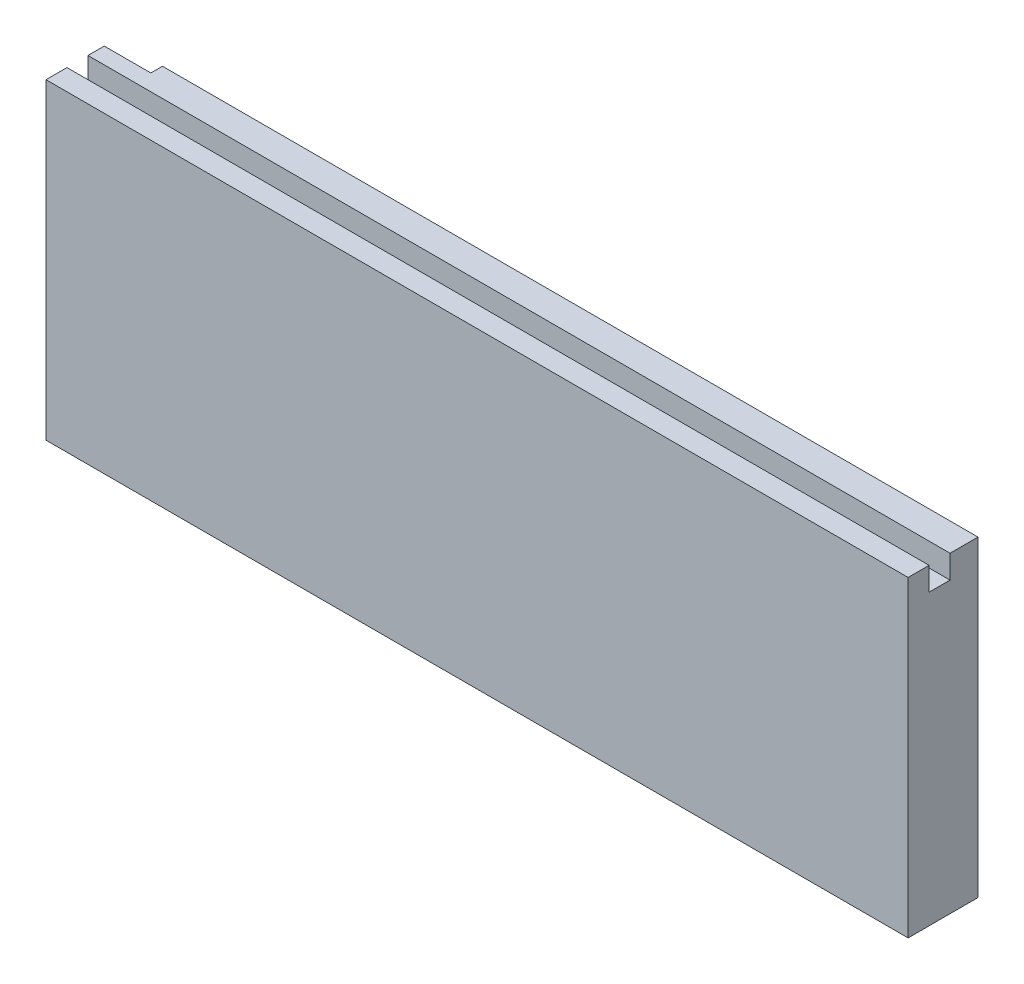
from build123d import *

# Parameters (mm, degrees)
ESQUISSE1_W              = 185
ESQUISSE1_H              = 67
BOSS_EXTRU_1_DEPTH       = 15
ESQUISSE14_W             = 10
ESQUISSE14_H             = 67
ENL_V_MAT_EXTRU_10_DEPTH = 2.5
ESQUISSE15_W             = 4.5
ESQUISSE15_H             = 5
ENL_V_MAT_EXTRU_11_DEPTH = 198.329673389
ENL_V_MAT_EXTRU_12_DEPTH = 4.5
ENL_V_MAT_EXTRU_13_DEPTH = 4.5


with BuildPart() as part:
    # Esquisse1 → Boss.-Extru.1 (new body)
    with BuildSketch(Plane.XY):
        with Locations((92.5, 33.5)):
            Rectangle(ESQUISSE1_W, ESQUISSE1_H)
    extrude(amount=BOSS_EXTRU_1_DEPTH)

    # Esquisse14 → Enl_v. mat.-Extru.10 (cut)
    with BuildSketch(Plane(origin=(0, 0, 0), x_dir=(-1, 0, 0), z_dir=(0, 0, -1))):
        with Locations((-5, 33.5)):
            Rectangle(ESQUISSE14_W, ESQUISSE14_H)
    extrude(amount=-ENL_V_MAT_EXTRU_10_DEPTH, mode=Mode.SUBTRACT)

    # Esquisse15 → Enl_v. mat.-Extru.11 (cut, through all)
    with BuildSketch(Plane(origin=(185, 0, 0), x_dir=(0, 0, -1), z_dir=(1, 0, 0))):
        with Locations((-8.25, 64.5)):
            Rectangle(ESQUISSE15_W, ESQUISSE15_H)
    extrude(amount=-ENL_V_MAT_EXTRU_11_DEPTH, mode=Mode.SUBTRACT)

    # Esquisse16 → Enl_v. mat.-Extru.12 (cut)
    with BuildSketch(Plane.XY.offset(6)):
        with BuildLine():
            Line((25, 62), (0, 62))
            Line((0, 62), (0, 49))
            add(Edge.make_bspline(
                [(0, 49), (3.155068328, 52.155068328), (8.943298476, 59.303041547), (15.963354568, 62), (25, 62)],
                knots=[0, 0, 0, 0, 0.382763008, 1, 1, 1, 1], degree=3))
        make_face()
    extrude(amount=ENL_V_MAT_EXTRU_12_DEPTH, mode=Mode.SUBTRACT)

    # Esquisse17 → Enl_v. mat.-Extru.13 (cut)
    with BuildSketch(Plane.XY.offset(6)):
        with BuildLine():
            Line((35, 65), (0, 65))
            Line((0, 65), (0, 49))
            add(Edge.make_bspline(
                [(0, 49), (9.773858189, 58.773858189), (19.582429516, 65), (35, 65)],
                knots=[0, 0, 0, 0, 1, 1, 1, 1], degree=3))
        make_face()
    extrude(amount=ENL_V_MAT_EXTRU_13_DEPTH, mode=Mode.SUBTRACT)


solid = part.part
